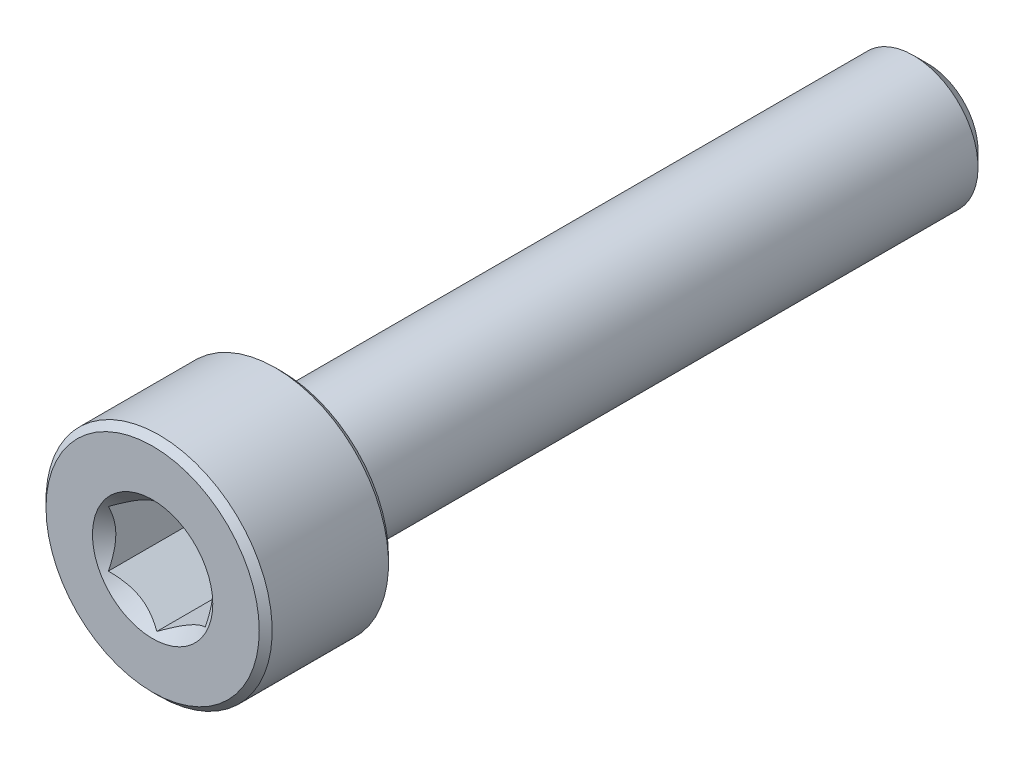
from build123d import *

# Parameters (mm, degrees)
CUT_EXTRUDE1_DEPTH = 3


with BuildPart() as part:
    # Sketch2 → Revolve1 (revolve)
    with BuildSketch(Plane(origin=(0, 0, 0), x_dir=(0, 0, -1), z_dir=(1, 0, 0))):
        with BuildLine():
            Line((-12, 0), (-12, 3.3))
            Line((-12, 3.3), (-11.8, 3.5))
            Line((-11.8, 3.5), (-8.2, 3.5))
            Line((-8.2, 3.5), (-8, 3.3))
            Line((-8, 3.3), (-8, 2.2))
            ThreePointArc((-8, 2.2), (-7.941421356, 2.058578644), (-7.8, 2))
            Line((-7.8, 2), (11.545336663, 2))
            Line((11.545336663, 2), (12, 1.545336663))
            Line((12, 1.545336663), (12, 0))
            Line((12, 0), (-12, 0))
        make_face()
    revolve(axis=Axis((0, 0, -12), (0, 0, 1)))

    # Sketch3 → Cut-Extrude1 (cut)
    with BuildSketch(Plane.XY.offset(12)):
        Polygon((1.5, -0.866025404), (1.5, 0.866025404), (0, 1.732050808), (-1.5, 0.866025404), (-1.5, -0.866025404), (0, -1.732050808), align=None)
    extrude(amount=-CUT_EXTRUDE1_DEPTH, mode=Mode.SUBTRACT)

    # Cut-Extrude2 cone 1 section (on through the dimple's axis) → Cut-Extrude2 (revolve, cut)
    with BuildSketch(Plane(origin=(0, 0, 12), x_dir=(0, -1, 0), z_dir=(1, 0, 0))):
        Polygon((0, 0), (1.861954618, 0), (0, 1.861954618), align=None)
    revolve(axis=Axis((0, 0, 12), (0, 0, -1)), mode=Mode.SUBTRACT)


solid = part.part
